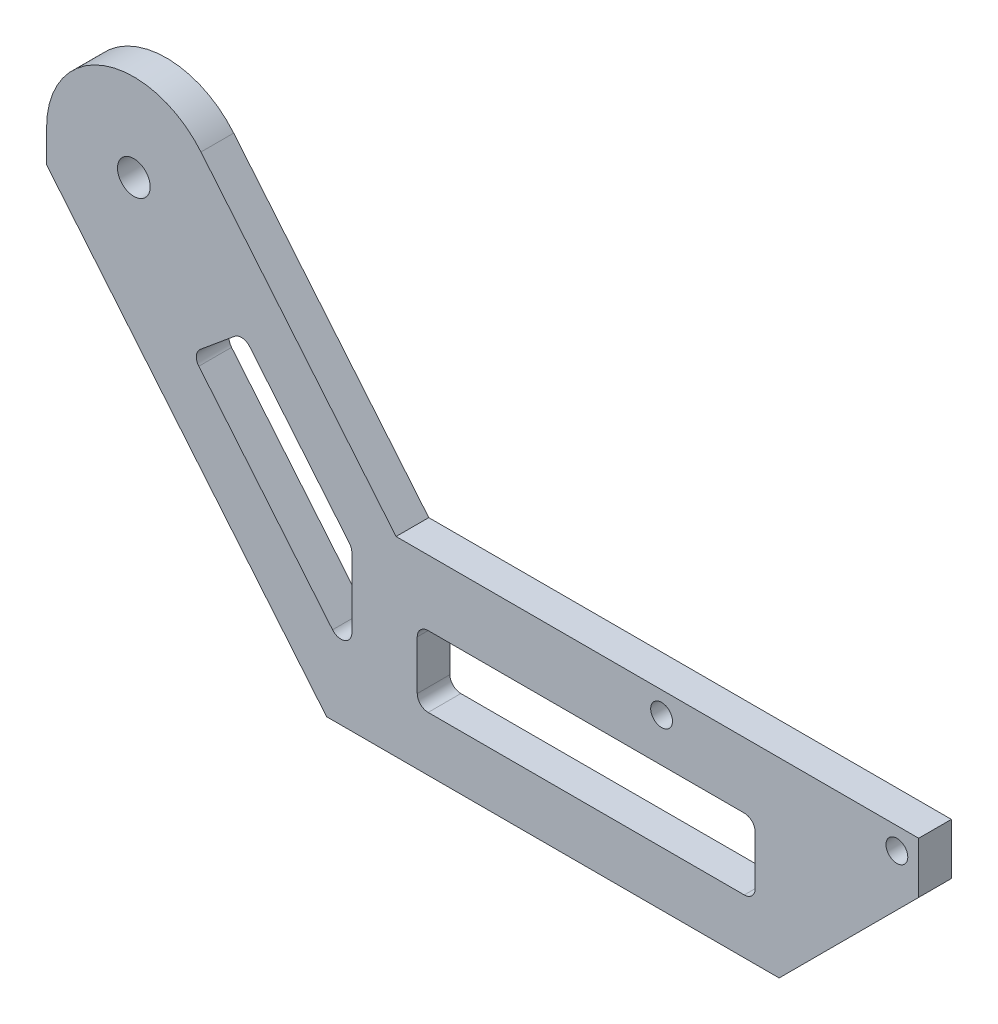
from build123d import *

# Parameters (mm, degrees)
SKETCH2_R           = 4.7625
SKETCH2_R_2         = 3.175
BOSS_EXTRUDE1_DEPTH = 4.7625
SKETCH3_R           = 2.3876
CUT_EXTRUDE1_DEPTH  = 15.24
SKETCH7_W           = 98.425
SKETCH7_H           = 20.6502
CUT_EXTRUDE3_DEPTH  = 6.35
FILLET1_R           = 3.175
SKETCH8_OUTSIDE_W   = 314.63
SKETCH8_OUTSIDE_H   = 206.68
CUT_EXTRUDE6_DEPTH  = 12.7
CHAMFER2_SIZE       = 40.64


with BuildPart() as part:
    # Sketch2 → Boss-Extrude1 (new, symmetric)
    with BuildSketch(Plane.XY):
        Polygon((-25.4, 25.4), (43.508022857, 25.4), (107.95, -52.3748), (228.6, -52.3748), (228.6, -120.65), (66.675, -120.65), (-25.4, -9.525), align=None)
        with Locations(Location((0, 0, 0), (0, 0, 180))):
            Circle(SKETCH2_R, mode=Mode.SUBTRACT)
        with Locations(Location((153.7208, -58.7248, 0), (0, 0, 180))):
            Circle(SKETCH2_R_2, mode=Mode.SUBTRACT)
        with Locations(Location((222.25, -58.7248, 0), (0, 0, 180))):
            Circle(SKETCH2_R_2, mode=Mode.SUBTRACT)
    extrude(amount=BOSS_EXTRUDE1_DEPTH, both=True)

    # Sketch3 → Cut-Extrude1 (cut)
    with BuildSketch(Plane(origin=(-19.740016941, -16.356014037, 0), x_dir=(0, 0, 1), z_dir=(-0.7700215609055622, -0.6380178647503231, 0))):
        with Locations(Location((0, 2.521198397, 0), (0, 0, 270))):
            Circle(SKETCH3_R)
        with Locations(Location((0, -22.878801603, 0), (0, 0, 270))):
            Circle(SKETCH3_R)
    extrude(amount=-CUT_EXTRUDE1_DEPTH, mode=Mode.SUBTRACT)

    # Sketch7 → Cut-Extrude3 (cut, symmetric)
    with BuildSketch(Plane.XY):
        Polygon((63.5, -91.936355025), (16.908745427, -35.70553054), (31.759125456, -23.400929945), (63.5, -61.708881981), align=None)
        with Locations((131.7625, -81.7499)):
            Rectangle(SKETCH7_W, SKETCH7_H)
    extrude(amount=CUT_EXTRUDE3_DEPTH, both=True, mode=Mode.SUBTRACT)

    # Fillet1
    fillet1_edges = [part.edges().sort_by_distance(p)[0] for p in [
        (63.5, -61.708881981, 0),
        (63.5, -91.936355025, 0),
        (16.908745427, -35.70553054, 0),
        (31.759125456, -23.400929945, 0),
        (180.975, -71.4248, 0),
        (180.975, -92.075, 0),
        (82.55, -92.075, 0),
        (82.55, -71.4248, 0),
    ]]
    fillet(fillet1_edges, radius=FILLET1_R)

    # Sketch8 outside → Cut-Extrude6 (cut, symmetric)
    with BuildSketch(Plane.XY):
        with Locations((101.6, -47.625)):
            Rectangle(SKETCH8_OUTSIDE_W, SKETCH8_OUTSIDE_H)
        with BuildLine():
            Line((19.558547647, 16.205653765), (76.382352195, -52.3748))
            Line((76.382352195, -52.3748), (107.95, -52.3748))
            Line((107.95, -52.3748), (228.6, -52.3748))
            Line((228.6, -52.3748), (228.6, -107.95))
            Line((228.6, -107.95), (104.775, -107.95))
            Line((104.775, -107.95), (56.152142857, -107.95))
            Line((56.152142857, -107.95), (-25.4, -9.525))
            Line((-25.4, -9.525), (-25.4, 0))
            ThreePointArc((-25.4, 0), (-8.613155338, 23.895052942), (19.558547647, 16.205653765))
        make_face(mode=Mode.SUBTRACT)
    extrude(amount=CUT_EXTRUDE6_DEPTH, both=True, mode=Mode.SUBTRACT)

    # Chamfer2
    chamfer2_edges = [part.edges().sort_by_distance(p)[0] for p in [
        (228.6, -107.95, 0),
    ]]
    chamfer(chamfer2_edges, length=CHAMFER2_SIZE)


solid = part.part
